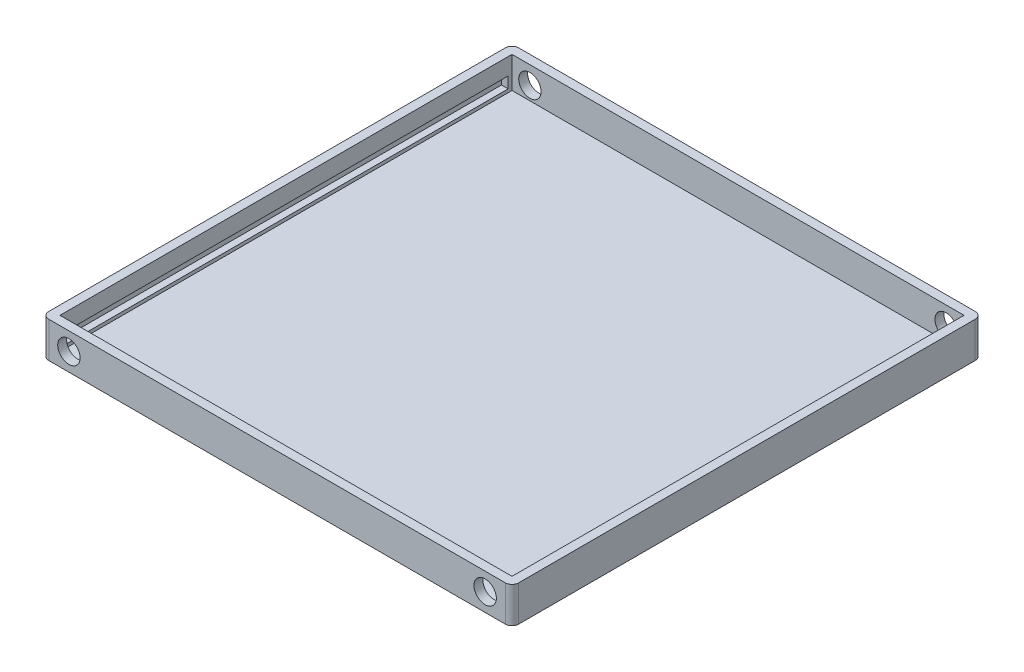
ISO-10303-21;
HEADER;
FILE_DESCRIPTION(('STEP AP214'),'2;1');
FILE_NAME('part.step','',(''),(''),'','','');
FILE_SCHEMA(('AUTOMOTIVE_DESIGN { 1 0 10303 214 1 1 1 1 }'));
ENDSEC;
DATA;
#1=APPLICATION_CONTEXT('core data for automotive mechanical design processes');
#2=APPLICATION_PROTOCOL_DEFINITION('international standard','automotive_design',2000,#1);
#3=PRODUCT_CONTEXT('',#1,'mechanical');
#4=PRODUCT('Part','Part','',(#3));
#5=PRODUCT_RELATED_PRODUCT_CATEGORY('part','',(#4));
#6=PRODUCT_DEFINITION_FORMATION('','',#4);
#7=PRODUCT_DEFINITION_CONTEXT('part definition',#1,'design');
#8=PRODUCT_DEFINITION('design','',#6,#7);
#9=PRODUCT_DEFINITION_SHAPE('','',#8);
#10=(LENGTH_UNIT() NAMED_UNIT(*) SI_UNIT(.MILLI.,.METRE.));
#11=(NAMED_UNIT(*) PLANE_ANGLE_UNIT() SI_UNIT($,.RADIAN.));
#12=(NAMED_UNIT(*) SI_UNIT($,.STERADIAN.) SOLID_ANGLE_UNIT());
#13=UNCERTAINTY_MEASURE_WITH_UNIT(LENGTH_MEASURE(1.E-05),#10,'distance_accuracy_value','');
#14=(GEOMETRIC_REPRESENTATION_CONTEXT(3) GLOBAL_UNCERTAINTY_ASSIGNED_CONTEXT((#13)) GLOBAL_UNIT_ASSIGNED_CONTEXT((#10,
#11,#12)) REPRESENTATION_CONTEXT('',''));
#15=CARTESIAN_POINT('',(0.,0.,0.));
#16=DIRECTION('',(0.,0.,1.));
#17=DIRECTION('',(1.,0.,0.));
#18=AXIS2_PLACEMENT_3D('',#15,#16,#17);
#19=CARTESIAN_POINT('',(50.5,1.,-50.5));
#20=DIRECTION('',(1.,0.,0.));
#21=DIRECTION('',(0.,0.,-1.));
#22=AXIS2_PLACEMENT_3D('',#19,#20,#21);
#23=PLANE('',#22);
#24=DIRECTION('',(0.,0.,-1.));
#25=VECTOR('',#24,1.);
#26=CARTESIAN_POINT('',(50.5,1.74932444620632,-49.6518393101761));
#27=LINE('',#26,#25);
#28=CARTESIAN_POINT('',(50.5,1.74932444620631,50.5));
#29=VERTEX_POINT('',#28);
#30=CARTESIAN_POINT('',(50.5,1.74932444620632,-49.6518393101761));
#31=VERTEX_POINT('',#30);
#32=EDGE_CURVE('E227',#29,#31,#27,.T.);
#33=ORIENTED_EDGE('',*,*,#32,.T.);
#34=DIRECTION('',(0.,1.,0.));
#35=VECTOR('',#34,1.);
#36=CARTESIAN_POINT('',(50.5,4.24932444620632,-49.6518393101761));
#37=LINE('',#36,#35);
#38=CARTESIAN_POINT('',(50.5,4.24932444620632,-49.6518393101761));
#39=VERTEX_POINT('',#38);
#40=EDGE_CURVE('E245',#31,#39,#37,.T.);
#41=ORIENTED_EDGE('',*,*,#40,.T.);
#42=DIRECTION('',(0.,0.,1.));
#43=VECTOR('',#42,1.);
#44=CARTESIAN_POINT('',(50.5,4.24932444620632,-49.6518393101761));
#45=LINE('',#44,#43);
#46=CARTESIAN_POINT('',(50.5,4.24932444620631,50.5));
#47=VERTEX_POINT('',#46);
#48=EDGE_CURVE('E241',#39,#47,#45,.T.);
#49=ORIENTED_EDGE('',*,*,#48,.T.);
#50=DIRECTION('',(0.,1.,0.));
#51=VECTOR('',#50,1.);
#52=CARTESIAN_POINT('',(50.5,1.,50.5));
#53=LINE('',#52,#51);
#54=CARTESIAN_POINT('',(50.5,8.,50.5));
#55=VERTEX_POINT('',#54);
#56=EDGE_CURVE('E349',#47,#55,#53,.T.);
#57=ORIENTED_EDGE('',*,*,#56,.T.);
#58=DIRECTION('',(0.,0.,-1.));
#59=VECTOR('',#58,1.);
#60=CARTESIAN_POINT('',(50.5,8.,-50.5));
#61=LINE('',#60,#59);
#62=CARTESIAN_POINT('',(50.5,8.,-50.5));
#63=VERTEX_POINT('',#62);
#64=EDGE_CURVE('E330',#55,#63,#61,.T.);
#65=ORIENTED_EDGE('',*,*,#64,.T.);
#66=DIRECTION('',(0.,1.,0.));
#67=VECTOR('',#66,1.);
#68=CARTESIAN_POINT('',(50.5,1.,-50.5));
#69=LINE('',#68,#67);
#70=CARTESIAN_POINT('',(50.5,1.,-50.5));
#71=VERTEX_POINT('',#70);
#72=EDGE_CURVE('E341',#71,#63,#69,.T.);
#73=ORIENTED_EDGE('',*,*,#72,.F.);
#74=DIRECTION('',(0.,0.,-1.));
#75=VECTOR('',#74,1.);
#76=CARTESIAN_POINT('',(50.5,1.,-50.5));
#77=LINE('',#76,#75);
#78=CARTESIAN_POINT('',(50.5,1.,50.5));
#79=VERTEX_POINT('',#78);
#80=EDGE_CURVE('E314',#79,#71,#77,.T.);
#81=ORIENTED_EDGE('',*,*,#80,.F.);
#82=EDGE_CURVE('E344',#79,#29,#53,.T.);
#83=ORIENTED_EDGE('',*,*,#82,.T.);
#84=EDGE_LOOP('',(#33,#41,#49,#57,#65,#73,#81,#83));
#85=FACE_BOUND('',#84,.T.);
#86=ADVANCED_FACE('F45',(#85),#23,.F.);
#87=CARTESIAN_POINT('',(-52.5,8.,-52.5));
#88=DIRECTION('',(1.,0.,0.));
#89=DIRECTION('',(0.,0.,-1.));
#90=AXIS2_PLACEMENT_3D('',#87,#88,#89);
#91=PLANE('',#90);
#92=DIRECTION('',(0.,0.,1.));
#93=VECTOR('',#92,1.);
#94=CARTESIAN_POINT('',(-52.5,8.,-52.5));
#95=LINE('',#94,#93);
#96=CARTESIAN_POINT('',(-52.5,8.,-51.));
#97=VERTEX_POINT('',#96);
#98=CARTESIAN_POINT('',(-52.5,8.,51.));
#99=VERTEX_POINT('',#98);
#100=EDGE_CURVE('E355',#97,#99,#95,.T.);
#101=ORIENTED_EDGE('',*,*,#100,.F.);
#102=DIRECTION('',(0.,-1.,0.));
#103=VECTOR('',#102,1.);
#104=CARTESIAN_POINT('',(-52.5,8.,-51.));
#105=LINE('',#104,#103);
#106=CARTESIAN_POINT('',(-52.5,0.,-51.));
#107=VERTEX_POINT('',#106);
#108=EDGE_CURVE('E387',#97,#107,#105,.T.);
#109=ORIENTED_EDGE('',*,*,#108,.T.);
#110=DIRECTION('',(0.,0.,1.));
#111=VECTOR('',#110,1.);
#112=CARTESIAN_POINT('',(-52.5,0.,-52.5));
#113=LINE('',#112,#111);
#114=CARTESIAN_POINT('',(-52.5,0.,51.));
#115=VERTEX_POINT('',#114);
#116=EDGE_CURVE('E340',#107,#115,#113,.T.);
#117=ORIENTED_EDGE('',*,*,#116,.T.);
#118=DIRECTION('',(0.,-1.,0.));
#119=VECTOR('',#118,1.);
#120=CARTESIAN_POINT('',(-52.5,8.,51.));
#121=LINE('',#120,#119);
#122=EDGE_CURVE('E371',#115,#99,#121,.F.);
#123=ORIENTED_EDGE('',*,*,#122,.T.);
#124=EDGE_LOOP('',(#101,#109,#117,#123));
#125=FACE_BOUND('',#124,.T.);
#126=ADVANCED_FACE('F470',(#125),#91,.F.);
#127=CARTESIAN_POINT('',(52.5,8.,52.5));
#128=DIRECTION('',(0.,0.,-1.));
#129=DIRECTION('',(-1.,0.,0.));
#130=AXIS2_PLACEMENT_3D('',#127,#128,#129);
#131=PLANE('',#130);
#132=CARTESIAN_POINT('',(-46.5,4.,52.5));
#133=DIRECTION('',(0.,0.,1.));
#134=DIRECTION('',(1.,0.,0.));
#135=AXIS2_PLACEMENT_3D('',#132,#133,#134);
#136=CIRCLE('',#135,2.5);
#137=CARTESIAN_POINT('',(-44.,4.,52.5));
#138=VERTEX_POINT('',#137);
#139=EDGE_CURVE('E435',#138,#138,#136,.T.);
#140=ORIENTED_EDGE('',*,*,#139,.F.);
#141=EDGE_LOOP('',(#140));
#142=FACE_BOUND('',#141,.T.);
#143=CARTESIAN_POINT('',(46.5,4.,52.5));
#144=DIRECTION('',(0.,0.,1.));
#145=DIRECTION('',(1.,0.,0.));
#146=AXIS2_PLACEMENT_3D('',#143,#144,#145);
#147=CIRCLE('',#146,2.5);
#148=CARTESIAN_POINT('',(49.,4.,52.5));
#149=VERTEX_POINT('',#148);
#150=EDGE_CURVE('E230',#149,#149,#147,.T.);
#151=ORIENTED_EDGE('',*,*,#150,.F.);
#152=EDGE_LOOP('',(#151));
#153=FACE_BOUND('',#152,.T.);
#154=DIRECTION('',(1.,0.,0.));
#155=VECTOR('',#154,1.);
#156=CARTESIAN_POINT('',(52.5,8.,52.5));
#157=LINE('',#156,#155);
#158=CARTESIAN_POINT('',(-51.,8.,52.5));
#159=VERTEX_POINT('',#158);
#160=CARTESIAN_POINT('',(51.,8.,52.5));
#161=VERTEX_POINT('',#160);
#162=EDGE_CURVE('E359',#159,#161,#157,.T.);
#163=ORIENTED_EDGE('',*,*,#162,.F.);
#164=DIRECTION('',(0.,-1.,0.));
#165=VECTOR('',#164,1.);
#166=CARTESIAN_POINT('',(-51.,8.,52.5));
#167=LINE('',#166,#165);
#168=CARTESIAN_POINT('',(-51.,0.,52.5));
#169=VERTEX_POINT('',#168);
#170=EDGE_CURVE('E425',#159,#169,#167,.T.);
#171=ORIENTED_EDGE('',*,*,#170,.T.);
#172=DIRECTION('',(1.,0.,0.));
#173=VECTOR('',#172,1.);
#174=CARTESIAN_POINT('',(52.5,0.,52.5));
#175=LINE('',#174,#173);
#176=CARTESIAN_POINT('',(51.,0.,52.5));
#177=VERTEX_POINT('',#176);
#178=EDGE_CURVE('E375',#169,#177,#175,.T.);
#179=ORIENTED_EDGE('',*,*,#178,.T.);
#180=DIRECTION('',(0.,-1.,0.));
#181=VECTOR('',#180,1.);
#182=CARTESIAN_POINT('',(51.,8.,52.5));
#183=LINE('',#182,#181);
#184=EDGE_CURVE('E422',#177,#161,#183,.F.);
#185=ORIENTED_EDGE('',*,*,#184,.T.);
#186=EDGE_LOOP('',(#163,#171,#179,#185));
#187=FACE_BOUND('',#186,.T.);
#188=ADVANCED_FACE('F466',(#142,#153,#187),#131,.F.);
#189=CARTESIAN_POINT('',(52.5,8.,-52.5));
#190=DIRECTION('',(-1.,0.,0.));
#191=DIRECTION('',(0.,0.,1.));
#192=AXIS2_PLACEMENT_3D('',#189,#190,#191);
#193=PLANE('',#192);
#194=DIRECTION('',(0.,0.,-1.));
#195=VECTOR('',#194,1.);
#196=CARTESIAN_POINT('',(52.5,8.,-52.5));
#197=LINE('',#196,#195);
#198=CARTESIAN_POINT('',(52.5,8.,51.));
#199=VERTEX_POINT('',#198);
#200=CARTESIAN_POINT('',(52.5,8.,-51.));
#201=VERTEX_POINT('',#200);
#202=EDGE_CURVE('E364',#199,#201,#197,.T.);
#203=ORIENTED_EDGE('',*,*,#202,.F.);
#204=DIRECTION('',(0.,-1.,0.));
#205=VECTOR('',#204,1.);
#206=CARTESIAN_POINT('',(52.5,8.,51.));
#207=LINE('',#206,#205);
#208=CARTESIAN_POINT('',(52.5,0.,51.));
#209=VERTEX_POINT('',#208);
#210=EDGE_CURVE('E11',#199,#209,#207,.T.);
#211=ORIENTED_EDGE('',*,*,#210,.T.);
#212=DIRECTION('',(0.,0.,-1.));
#213=VECTOR('',#212,1.);
#214=CARTESIAN_POINT('',(52.5,0.,-52.5));
#215=LINE('',#214,#213);
#216=CARTESIAN_POINT('',(52.5,0.,-51.));
#217=VERTEX_POINT('',#216);
#218=EDGE_CURVE('E379',#209,#217,#215,.T.);
#219=ORIENTED_EDGE('',*,*,#218,.T.);
#220=DIRECTION('',(0.,-1.,0.));
#221=VECTOR('',#220,1.);
#222=CARTESIAN_POINT('',(52.5,8.,-51.));
#223=LINE('',#222,#221);
#224=EDGE_CURVE('E55',#217,#201,#223,.F.);
#225=ORIENTED_EDGE('',*,*,#224,.T.);
#226=EDGE_LOOP('',(#203,#211,#219,#225));
#227=FACE_BOUND('',#226,.T.);
#228=ADVANCED_FACE('F469',(#227),#193,.F.);
#229=CARTESIAN_POINT('',(52.5,8.,-52.5));
#230=DIRECTION('',(0.,0.,1.));
#231=DIRECTION('',(1.,0.,0.));
#232=AXIS2_PLACEMENT_3D('',#229,#230,#231);
#233=PLANE('',#232);
#234=CARTESIAN_POINT('',(-46.5,4.,-52.5));
#235=DIRECTION('',(0.,0.,1.));
#236=DIRECTION('',(1.,0.,0.));
#237=AXIS2_PLACEMENT_3D('',#234,#235,#236);
#238=CIRCLE('',#237,2.5);
#239=CARTESIAN_POINT('',(-44.,4.,-52.5));
#240=VERTEX_POINT('',#239);
#241=EDGE_CURVE('E441',#240,#240,#238,.T.);
#242=ORIENTED_EDGE('',*,*,#241,.T.);
#243=EDGE_LOOP('',(#242));
#244=FACE_BOUND('',#243,.T.);
#245=CARTESIAN_POINT('',(46.5,4.,-52.5));
#246=DIRECTION('',(0.,0.,1.));
#247=DIRECTION('',(1.,0.,0.));
#248=AXIS2_PLACEMENT_3D('',#245,#246,#247);
#249=CIRCLE('',#248,2.5);
#250=CARTESIAN_POINT('',(49.,4.,-52.5));
#251=VERTEX_POINT('',#250);
#252=EDGE_CURVE('E448',#251,#251,#249,.T.);
#253=ORIENTED_EDGE('',*,*,#252,.T.);
#254=EDGE_LOOP('',(#253));
#255=FACE_BOUND('',#254,.T.);
#256=DIRECTION('',(-1.,0.,0.));
#257=VECTOR('',#256,1.);
#258=CARTESIAN_POINT('',(52.5,0.,-52.5));
#259=LINE('',#258,#257);
#260=CARTESIAN_POINT('',(51.,0.,-52.5));
#261=VERTEX_POINT('',#260);
#262=CARTESIAN_POINT('',(-51.,0.,-52.5));
#263=VERTEX_POINT('',#262);
#264=EDGE_CURVE('E360',#261,#263,#259,.T.);
#265=ORIENTED_EDGE('',*,*,#264,.T.);
#266=DIRECTION('',(0.,-1.,0.));
#267=VECTOR('',#266,1.);
#268=CARTESIAN_POINT('',(-51.,8.,-52.5));
#269=LINE('',#268,#267);
#270=CARTESIAN_POINT('',(-51.,8.,-52.5));
#271=VERTEX_POINT('',#270);
#272=EDGE_CURVE('E407',#263,#271,#269,.F.);
#273=ORIENTED_EDGE('',*,*,#272,.T.);
#274=DIRECTION('',(-1.,0.,0.));
#275=VECTOR('',#274,1.);
#276=CARTESIAN_POINT('',(52.5,8.,-52.5));
#277=LINE('',#276,#275);
#278=CARTESIAN_POINT('',(51.,8.,-52.5));
#279=VERTEX_POINT('',#278);
#280=EDGE_CURVE('E367',#279,#271,#277,.T.);
#281=ORIENTED_EDGE('',*,*,#280,.F.);
#282=DIRECTION('',(0.,-1.,0.));
#283=VECTOR('',#282,1.);
#284=CARTESIAN_POINT('',(51.,8.,-52.5));
#285=LINE('',#284,#283);
#286=EDGE_CURVE('E403',#279,#261,#285,.T.);
#287=ORIENTED_EDGE('',*,*,#286,.T.);
#288=EDGE_LOOP('',(#265,#273,#281,#287));
#289=FACE_BOUND('',#288,.T.);
#290=ADVANCED_FACE('F495',(#244,#255,#289),#233,.F.);
#291=CARTESIAN_POINT('',(0.,8.,0.));
#292=DIRECTION('',(0.,-1.,0.));
#293=DIRECTION('',(0.,0.,-1.));
#294=AXIS2_PLACEMENT_3D('',#291,#292,#293);
#295=PLANE('',#294);
#296=DIRECTION('',(1.,0.,0.));
#297=VECTOR('',#296,1.);
#298=CARTESIAN_POINT('',(50.5,8.,50.5));
#299=LINE('',#298,#297);
#300=CARTESIAN_POINT('',(-50.5,8.,50.5));
#301=VERTEX_POINT('',#300);
#302=EDGE_CURVE('E326',#301,#55,#299,.T.);
#303=ORIENTED_EDGE('',*,*,#302,.F.);
#304=DIRECTION('',(0.,0.,1.));
#305=VECTOR('',#304,1.);
#306=CARTESIAN_POINT('',(-50.5,8.,-50.5));
#307=LINE('',#306,#305);
#308=CARTESIAN_POINT('',(-50.5,8.,-50.5));
#309=VERTEX_POINT('',#308);
#310=EDGE_CURVE('E295',#309,#301,#307,.T.);
#311=ORIENTED_EDGE('',*,*,#310,.F.);
#312=DIRECTION('',(-1.,0.,0.));
#313=VECTOR('',#312,1.);
#314=CARTESIAN_POINT('',(50.5,8.,-50.5));
#315=LINE('',#314,#313);
#316=EDGE_CURVE('E310',#63,#309,#315,.T.);
#317=ORIENTED_EDGE('',*,*,#316,.F.);
#318=ORIENTED_EDGE('',*,*,#64,.F.);
#319=EDGE_LOOP('',(#303,#311,#317,#318));
#320=FACE_BOUND('',#319,.T.);
#321=ORIENTED_EDGE('',*,*,#280,.T.);
#322=CARTESIAN_POINT('',(-51.,8.,-51.));
#323=DIRECTION('',(0.,-1.,0.));
#324=DIRECTION('',(0.,0.,-1.));
#325=AXIS2_PLACEMENT_3D('',#322,#323,#324);
#326=CIRCLE('',#325,1.5);
#327=EDGE_CURVE('E419',#271,#97,#326,.F.);
#328=ORIENTED_EDGE('',*,*,#327,.T.);
#329=ORIENTED_EDGE('',*,*,#100,.T.);
#330=CARTESIAN_POINT('',(-51.,8.,51.));
#331=DIRECTION('',(0.,-1.,0.));
#332=DIRECTION('',(0.,0.,-1.));
#333=AXIS2_PLACEMENT_3D('',#330,#331,#332);
#334=CIRCLE('',#333,1.5);
#335=EDGE_CURVE('E416',#99,#159,#334,.F.);
#336=ORIENTED_EDGE('',*,*,#335,.T.);
#337=ORIENTED_EDGE('',*,*,#162,.T.);
#338=CARTESIAN_POINT('',(51.,8.,51.));
#339=DIRECTION('',(0.,-1.,0.));
#340=DIRECTION('',(0.,0.,-1.));
#341=AXIS2_PLACEMENT_3D('',#338,#339,#340);
#342=CIRCLE('',#341,1.5);
#343=EDGE_CURVE('E413',#161,#199,#342,.F.);
#344=ORIENTED_EDGE('',*,*,#343,.T.);
#345=ORIENTED_EDGE('',*,*,#202,.T.);
#346=CARTESIAN_POINT('',(51.,8.,-51.));
#347=DIRECTION('',(0.,-1.,0.));
#348=DIRECTION('',(0.,0.,-1.));
#349=AXIS2_PLACEMENT_3D('',#346,#347,#348);
#350=CIRCLE('',#349,1.5);
#351=EDGE_CURVE('E410',#201,#279,#350,.F.);
#352=ORIENTED_EDGE('',*,*,#351,.T.);
#353=EDGE_LOOP('',(#321,#328,#329,#336,#337,#344,#345,#352));
#354=FACE_BOUND('',#353,.T.);
#355=ADVANCED_FACE('F504',(#320,#354),#295,.F.);
#356=CARTESIAN_POINT('',(0.,0.,0.));
#357=DIRECTION('',(0.,-1.,0.));
#358=DIRECTION('',(0.,0.,-1.));
#359=AXIS2_PLACEMENT_3D('',#356,#357,#358);
#360=PLANE('',#359);
#361=ORIENTED_EDGE('',*,*,#116,.F.);
#362=CARTESIAN_POINT('',(-51.,0.,-51.));
#363=DIRECTION('',(0.,-1.,0.));
#364=DIRECTION('',(0.,0.,-1.));
#365=AXIS2_PLACEMENT_3D('',#362,#363,#364);
#366=CIRCLE('',#365,1.5);
#367=EDGE_CURVE('E400',#107,#263,#366,.T.);
#368=ORIENTED_EDGE('',*,*,#367,.T.);
#369=ORIENTED_EDGE('',*,*,#264,.F.);
#370=CARTESIAN_POINT('',(51.,0.,-51.));
#371=DIRECTION('',(0.,-1.,0.));
#372=DIRECTION('',(0.,0.,-1.));
#373=AXIS2_PLACEMENT_3D('',#370,#371,#372);
#374=CIRCLE('',#373,1.5);
#375=EDGE_CURVE('E391',#261,#217,#374,.T.);
#376=ORIENTED_EDGE('',*,*,#375,.T.);
#377=ORIENTED_EDGE('',*,*,#218,.F.);
#378=CARTESIAN_POINT('',(51.,0.,51.));
#379=DIRECTION('',(0.,-1.,0.));
#380=DIRECTION('',(0.,0.,-1.));
#381=AXIS2_PLACEMENT_3D('',#378,#379,#380);
#382=CIRCLE('',#381,1.5);
#383=EDGE_CURVE('E394',#209,#177,#382,.T.);
#384=ORIENTED_EDGE('',*,*,#383,.T.);
#385=ORIENTED_EDGE('',*,*,#178,.F.);
#386=CARTESIAN_POINT('',(-51.,0.,51.));
#387=DIRECTION('',(0.,-1.,0.));
#388=DIRECTION('',(0.,0.,-1.));
#389=AXIS2_PLACEMENT_3D('',#386,#387,#388);
#390=CIRCLE('',#389,1.5);
#391=EDGE_CURVE('E397',#169,#115,#390,.T.);
#392=ORIENTED_EDGE('',*,*,#391,.T.);
#393=EDGE_LOOP('',(#361,#368,#369,#376,#377,#384,#385,#392));
#394=FACE_BOUND('',#393,.T.);
#395=ADVANCED_FACE('F485',(#394),#360,.T.);
#396=CARTESIAN_POINT('',(-50.5,1.,-50.5));
#397=DIRECTION('',(-1.,0.,0.));
#398=DIRECTION('',(0.,0.,1.));
#399=AXIS2_PLACEMENT_3D('',#396,#397,#398);
#400=PLANE('',#399);
#401=DIRECTION('',(0.,1.,0.));
#402=VECTOR('',#401,1.);
#403=CARTESIAN_POINT('',(-50.5,1.,50.5));
#404=LINE('',#403,#402);
#405=CARTESIAN_POINT('',(-50.5,4.24932444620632,50.5));
#406=VERTEX_POINT('',#405);
#407=EDGE_CURVE('E322',#406,#301,#404,.T.);
#408=ORIENTED_EDGE('',*,*,#407,.F.);
#409=DIRECTION('',(0.,0.,1.));
#410=VECTOR('',#409,1.);
#411=CARTESIAN_POINT('',(-50.5,4.24932444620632,-49.6518393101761));
#412=LINE('',#411,#410);
#413=CARTESIAN_POINT('',(-50.5,4.24932444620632,-49.6518393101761));
#414=VERTEX_POINT('',#413);
#415=EDGE_CURVE('E263',#414,#406,#412,.T.);
#416=ORIENTED_EDGE('',*,*,#415,.F.);
#417=DIRECTION('',(0.,1.,0.));
#418=VECTOR('',#417,1.);
#419=CARTESIAN_POINT('',(-50.5,4.24932444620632,-49.6518393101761));
#420=LINE('',#419,#418);
#421=CARTESIAN_POINT('',(-50.5,1.74932444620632,-49.6518393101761));
#422=VERTEX_POINT('',#421);
#423=EDGE_CURVE('E284',#422,#414,#420,.T.);
#424=ORIENTED_EDGE('',*,*,#423,.F.);
#425=DIRECTION('',(0.,0.,-1.));
#426=VECTOR('',#425,1.);
#427=CARTESIAN_POINT('',(-50.5,1.74932444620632,-49.6518393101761));
#428=LINE('',#427,#426);
#429=CARTESIAN_POINT('',(-50.5,1.74932444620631,50.5));
#430=VERTEX_POINT('',#429);
#431=EDGE_CURVE('E279',#430,#422,#428,.T.);
#432=ORIENTED_EDGE('',*,*,#431,.F.);
#433=CARTESIAN_POINT('',(-50.5,1.,50.5));
#434=VERTEX_POINT('',#433);
#435=EDGE_CURVE('E350',#434,#430,#404,.T.);
#436=ORIENTED_EDGE('',*,*,#435,.F.);
#437=DIRECTION('',(0.,0.,1.));
#438=VECTOR('',#437,1.);
#439=CARTESIAN_POINT('',(-50.5,1.,-50.5));
#440=LINE('',#439,#438);
#441=CARTESIAN_POINT('',(-50.5,1.,-50.5));
#442=VERTEX_POINT('',#441);
#443=EDGE_CURVE('E305',#442,#434,#440,.T.);
#444=ORIENTED_EDGE('',*,*,#443,.F.);
#445=DIRECTION('',(0.,1.,0.));
#446=VECTOR('',#445,1.);
#447=CARTESIAN_POINT('',(-50.5,1.,-50.5));
#448=LINE('',#447,#446);
#449=EDGE_CURVE('E337',#442,#309,#448,.T.);
#450=ORIENTED_EDGE('',*,*,#449,.T.);
#451=ORIENTED_EDGE('',*,*,#310,.T.);
#452=EDGE_LOOP('',(#408,#416,#424,#432,#436,#444,#450,#451));
#453=FACE_BOUND('',#452,.T.);
#454=ADVANCED_FACE('F512',(#453),#400,.F.);
#455=CARTESIAN_POINT('',(50.5,1.,-50.5));
#456=DIRECTION('',(0.,0.,-1.));
#457=DIRECTION('',(-1.,0.,0.));
#458=AXIS2_PLACEMENT_3D('',#455,#456,#457);
#459=PLANE('',#458);
#460=CARTESIAN_POINT('',(-46.5,4.,-50.5));
#461=DIRECTION('',(0.,0.,-1.));
#462=DIRECTION('',(-1.,0.,0.));
#463=AXIS2_PLACEMENT_3D('',#460,#461,#462);
#464=CIRCLE('',#463,2.5);
#465=CARTESIAN_POINT('',(-49.,4.,-50.5));
#466=VERTEX_POINT('',#465);
#467=EDGE_CURVE('E49',#466,#466,#464,.F.);
#468=ORIENTED_EDGE('',*,*,#467,.F.);
#469=EDGE_LOOP('',(#468));
#470=FACE_BOUND('',#469,.T.);
#471=CARTESIAN_POINT('',(46.5,4.,-50.5));
#472=DIRECTION('',(0.,0.,-1.));
#473=DIRECTION('',(-1.,0.,0.));
#474=AXIS2_PLACEMENT_3D('',#471,#472,#473);
#475=CIRCLE('',#474,2.5);
#476=CARTESIAN_POINT('',(44.,4.,-50.5));
#477=VERTEX_POINT('',#476);
#478=EDGE_CURVE('E438',#477,#477,#475,.F.);
#479=ORIENTED_EDGE('',*,*,#478,.F.);
#480=EDGE_LOOP('',(#479));
#481=FACE_BOUND('',#480,.T.);
#482=ORIENTED_EDGE('',*,*,#316,.T.);
#483=ORIENTED_EDGE('',*,*,#449,.F.);
#484=DIRECTION('',(-1.,0.,0.));
#485=VECTOR('',#484,1.);
#486=CARTESIAN_POINT('',(50.5,1.,-50.5));
#487=LINE('',#486,#485);
#488=EDGE_CURVE('E318',#71,#442,#487,.T.);
#489=ORIENTED_EDGE('',*,*,#488,.F.);
#490=ORIENTED_EDGE('',*,*,#72,.T.);
#491=EDGE_LOOP('',(#482,#483,#489,#490));
#492=FACE_BOUND('',#491,.T.);
#493=ADVANCED_FACE('F530',(#470,#481,#492),#459,.F.);
#494=CARTESIAN_POINT('',(50.5,1.,50.5));
#495=DIRECTION('',(0.,0.,1.));
#496=DIRECTION('',(1.,0.,0.));
#497=AXIS2_PLACEMENT_3D('',#494,#495,#496);
#498=PLANE('',#497);
#499=CARTESIAN_POINT('',(-46.5,4.,50.5));
#500=DIRECTION('',(0.,0.,1.));
#501=DIRECTION('',(1.,0.,0.));
#502=AXIS2_PLACEMENT_3D('',#499,#500,#501);
#503=CIRCLE('',#502,2.5);
#504=CARTESIAN_POINT('',(-44.,4.,50.5));
#505=VERTEX_POINT('',#504);
#506=EDGE_CURVE('E240',#505,#505,#503,.T.);
#507=ORIENTED_EDGE('',*,*,#506,.T.);
#508=EDGE_LOOP('',(#507));
#509=FACE_BOUND('',#508,.T.);
#510=CARTESIAN_POINT('',(46.5,4.,50.5));
#511=DIRECTION('',(0.,0.,1.));
#512=DIRECTION('',(1.,0.,0.));
#513=AXIS2_PLACEMENT_3D('',#510,#511,#512);
#514=CIRCLE('',#513,2.5);
#515=CARTESIAN_POINT('',(49.,4.,50.5));
#516=VERTEX_POINT('',#515);
#517=EDGE_CURVE('E431',#516,#516,#514,.T.);
#518=ORIENTED_EDGE('',*,*,#517,.T.);
#519=EDGE_LOOP('',(#518));
#520=FACE_BOUND('',#519,.T.);
#521=ORIENTED_EDGE('',*,*,#302,.T.);
#522=ORIENTED_EDGE('',*,*,#56,.F.);
#523=EDGE_CURVE('E348',#29,#47,#53,.T.);
#524=ORIENTED_EDGE('',*,*,#523,.F.);
#525=ORIENTED_EDGE('',*,*,#82,.F.);
#526=DIRECTION('',(1.,0.,0.));
#527=VECTOR('',#526,1.);
#528=CARTESIAN_POINT('',(50.5,1.,50.5));
#529=LINE('',#528,#527);
#530=EDGE_CURVE('E309',#434,#79,#529,.T.);
#531=ORIENTED_EDGE('',*,*,#530,.F.);
#532=ORIENTED_EDGE('',*,*,#435,.T.);
#533=EDGE_CURVE('E354',#430,#406,#404,.T.);
#534=ORIENTED_EDGE('',*,*,#533,.T.);
#535=ORIENTED_EDGE('',*,*,#407,.T.);
#536=EDGE_LOOP('',(#521,#522,#524,#525,#531,#532,#534,#535));
#537=FACE_BOUND('',#536,.T.);
#538=ADVANCED_FACE('F532',(#509,#520,#537),#498,.F.);
#539=CARTESIAN_POINT('',(0.,1.,0.));
#540=DIRECTION('',(0.,-1.,0.));
#541=DIRECTION('',(0.,0.,-1.));
#542=AXIS2_PLACEMENT_3D('',#539,#540,#541);
#543=PLANE('',#542);
#544=ORIENTED_EDGE('',*,*,#443,.T.);
#545=ORIENTED_EDGE('',*,*,#530,.T.);
#546=ORIENTED_EDGE('',*,*,#80,.T.);
#547=ORIENTED_EDGE('',*,*,#488,.T.);
#548=EDGE_LOOP('',(#544,#545,#546,#547));
#549=FACE_BOUND('',#548,.T.);
#550=ADVANCED_FACE('F534',(#549),#543,.F.);
#551=CARTESIAN_POINT('',(-50.5,0.,0.));
#552=DIRECTION('',(-1.,0.,0.));
#553=DIRECTION('',(0.,0.,1.));
#554=AXIS2_PLACEMENT_3D('',#551,#552,#553);
#555=PLANE('',#554);
#556=ORIENTED_EDGE('',*,*,#533,.F.);
#557=CARTESIAN_POINT('',(-50.5,1.74932444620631,51.3481606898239));
#558=VERTEX_POINT('',#557);
#559=EDGE_CURVE('E280',#558,#430,#428,.T.);
#560=ORIENTED_EDGE('',*,*,#559,.F.);
#561=DIRECTION('',(0.,-1.,0.));
#562=VECTOR('',#561,1.);
#563=CARTESIAN_POINT('',(-50.5,4.24932444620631,51.3481606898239));
#564=LINE('',#563,#562);
#565=CARTESIAN_POINT('',(-50.5,4.24932444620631,51.3481606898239));
#566=VERTEX_POINT('',#565);
#567=EDGE_CURVE('E252',#566,#558,#564,.T.);
#568=ORIENTED_EDGE('',*,*,#567,.F.);
#569=EDGE_CURVE('E288',#406,#566,#412,.T.);
#570=ORIENTED_EDGE('',*,*,#569,.F.);
#571=EDGE_LOOP('',(#556,#560,#568,#570));
#572=FACE_BOUND('',#571,.T.);
#573=ADVANCED_FACE('F572',(#572),#555,.T.);
#574=CARTESIAN_POINT('',(-52.,4.24932444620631,51.3481606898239));
#575=DIRECTION('',(0.,0.,1.));
#576=DIRECTION('',(1.,0.,0.));
#577=AXIS2_PLACEMENT_3D('',#574,#575,#576);
#578=PLANE('',#577);
#579=ORIENTED_EDGE('',*,*,#567,.T.);
#580=DIRECTION('',(1.,0.,0.));
#581=VECTOR('',#580,1.);
#582=CARTESIAN_POINT('',(-52.,1.74932444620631,51.3481606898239));
#583=LINE('',#582,#581);
#584=CARTESIAN_POINT('',(-52.,1.74932444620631,51.3481606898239));
#585=VERTEX_POINT('',#584);
#586=EDGE_CURVE('E275',#585,#558,#583,.T.);
#587=ORIENTED_EDGE('',*,*,#586,.F.);
#588=DIRECTION('',(0.,-1.,0.));
#589=VECTOR('',#588,1.);
#590=CARTESIAN_POINT('',(-52.,4.24932444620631,51.3481606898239));
#591=LINE('',#590,#589);
#592=CARTESIAN_POINT('',(-52.,4.24932444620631,51.3481606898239));
#593=VERTEX_POINT('',#592);
#594=EDGE_CURVE('E258',#593,#585,#591,.T.);
#595=ORIENTED_EDGE('',*,*,#594,.F.);
#596=DIRECTION('',(1.,0.,0.));
#597=VECTOR('',#596,1.);
#598=CARTESIAN_POINT('',(-52.,4.24932444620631,51.3481606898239));
#599=LINE('',#598,#597);
#600=EDGE_CURVE('E291',#593,#566,#599,.T.);
#601=ORIENTED_EDGE('',*,*,#600,.T.);
#602=EDGE_LOOP('',(#579,#587,#595,#601));
#603=FACE_BOUND('',#602,.T.);
#604=ADVANCED_FACE('F573',(#603),#578,.F.);
#605=CARTESIAN_POINT('',(-52.,4.24932444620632,-49.6518393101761));
#606=DIRECTION('',(0.,1.,0.));
#607=DIRECTION('',(0.,0.,1.));
#608=AXIS2_PLACEMENT_3D('',#605,#606,#607);
#609=PLANE('',#608);
#610=ORIENTED_EDGE('',*,*,#415,.T.);
#611=ORIENTED_EDGE('',*,*,#569,.T.);
#612=ORIENTED_EDGE('',*,*,#600,.F.);
#613=DIRECTION('',(0.,0.,1.));
#614=VECTOR('',#613,1.);
#615=CARTESIAN_POINT('',(-52.,4.24932444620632,-49.6518393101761));
#616=LINE('',#615,#614);
#617=CARTESIAN_POINT('',(-52.,4.24932444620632,-49.6518393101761));
#618=VERTEX_POINT('',#617);
#619=EDGE_CURVE('E271',#618,#593,#616,.T.);
#620=ORIENTED_EDGE('',*,*,#619,.F.);
#621=DIRECTION('',(1.,0.,0.));
#622=VECTOR('',#621,1.);
#623=CARTESIAN_POINT('',(-52.,4.24932444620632,-49.6518393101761));
#624=LINE('',#623,#622);
#625=EDGE_CURVE('E296',#618,#414,#624,.T.);
#626=ORIENTED_EDGE('',*,*,#625,.T.);
#627=EDGE_LOOP('',(#610,#611,#612,#620,#626));
#628=FACE_BOUND('',#627,.T.);
#629=ADVANCED_FACE('F575',(#628),#609,.F.);
#630=CARTESIAN_POINT('',(-52.,4.24932444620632,-49.6518393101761));
#631=DIRECTION('',(0.,0.,-1.));
#632=DIRECTION('',(-1.,0.,0.));
#633=AXIS2_PLACEMENT_3D('',#630,#631,#632);
#634=PLANE('',#633);
#635=ORIENTED_EDGE('',*,*,#423,.T.);
#636=ORIENTED_EDGE('',*,*,#625,.F.);
#637=DIRECTION('',(0.,1.,0.));
#638=VECTOR('',#637,1.);
#639=CARTESIAN_POINT('',(-52.,4.24932444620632,-49.6518393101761));
#640=LINE('',#639,#638);
#641=CARTESIAN_POINT('',(-52.,1.74932444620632,-49.6518393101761));
#642=VERTEX_POINT('',#641);
#643=EDGE_CURVE('E267',#642,#618,#640,.T.);
#644=ORIENTED_EDGE('',*,*,#643,.F.);
#645=DIRECTION('',(1.,0.,0.));
#646=VECTOR('',#645,1.);
#647=CARTESIAN_POINT('',(-52.,1.74932444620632,-49.6518393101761));
#648=LINE('',#647,#646);
#649=EDGE_CURVE('E299',#642,#422,#648,.T.);
#650=ORIENTED_EDGE('',*,*,#649,.T.);
#651=EDGE_LOOP('',(#635,#636,#644,#650));
#652=FACE_BOUND('',#651,.T.);
#653=ADVANCED_FACE('F565',(#652),#634,.F.);
#654=CARTESIAN_POINT('',(-52.,1.74932444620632,-49.6518393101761));
#655=DIRECTION('',(0.,-1.,0.));
#656=DIRECTION('',(0.,0.,-1.));
#657=AXIS2_PLACEMENT_3D('',#654,#655,#656);
#658=PLANE('',#657);
#659=ORIENTED_EDGE('',*,*,#559,.T.);
#660=ORIENTED_EDGE('',*,*,#431,.T.);
#661=ORIENTED_EDGE('',*,*,#649,.F.);
#662=DIRECTION('',(0.,0.,-1.));
#663=VECTOR('',#662,1.);
#664=CARTESIAN_POINT('',(-52.,1.74932444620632,-49.6518393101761));
#665=LINE('',#664,#663);
#666=EDGE_CURVE('E262',#585,#642,#665,.T.);
#667=ORIENTED_EDGE('',*,*,#666,.F.);
#668=ORIENTED_EDGE('',*,*,#586,.T.);
#669=EDGE_LOOP('',(#659,#660,#661,#667,#668));
#670=FACE_BOUND('',#669,.T.);
#671=ADVANCED_FACE('F561',(#670),#658,.F.);
#672=CARTESIAN_POINT('',(-52.,0.,0.));
#673=DIRECTION('',(-1.,0.,0.));
#674=DIRECTION('',(0.,0.,1.));
#675=AXIS2_PLACEMENT_3D('',#672,#673,#674);
#676=PLANE('',#675);
#677=ORIENTED_EDGE('',*,*,#594,.T.);
#678=ORIENTED_EDGE('',*,*,#666,.T.);
#679=ORIENTED_EDGE('',*,*,#643,.T.);
#680=ORIENTED_EDGE('',*,*,#619,.T.);
#681=EDGE_LOOP('',(#677,#678,#679,#680));
#682=FACE_BOUND('',#681,.T.);
#683=ADVANCED_FACE('F568',(#682),#676,.F.);
#684=CARTESIAN_POINT('',(-51.,8.,-51.));
#685=DIRECTION('',(0.,-1.,0.));
#686=DIRECTION('',(0.,0.,-1.));
#687=AXIS2_PLACEMENT_3D('',#684,#685,#686);
#688=CYLINDRICAL_SURFACE('',#687,1.5);
#689=ORIENTED_EDGE('',*,*,#327,.F.);
#690=ORIENTED_EDGE('',*,*,#272,.F.);
#691=ORIENTED_EDGE('',*,*,#367,.F.);
#692=ORIENTED_EDGE('',*,*,#108,.F.);
#693=EDGE_LOOP('',(#689,#690,#691,#692));
#694=FACE_BOUND('',#693,.T.);
#695=ADVANCED_FACE('F491',(#694),#688,.T.);
#696=CARTESIAN_POINT('',(-51.,8.,51.));
#697=DIRECTION('',(0.,-1.,0.));
#698=DIRECTION('',(0.,0.,-1.));
#699=AXIS2_PLACEMENT_3D('',#696,#697,#698);
#700=CYLINDRICAL_SURFACE('',#699,1.5);
#701=ORIENTED_EDGE('',*,*,#335,.F.);
#702=ORIENTED_EDGE('',*,*,#122,.F.);
#703=ORIENTED_EDGE('',*,*,#391,.F.);
#704=ORIENTED_EDGE('',*,*,#170,.F.);
#705=EDGE_LOOP('',(#701,#702,#703,#704));
#706=FACE_BOUND('',#705,.T.);
#707=ADVANCED_FACE('F481',(#706),#700,.T.);
#708=CARTESIAN_POINT('',(51.,8.,51.));
#709=DIRECTION('',(0.,-1.,0.));
#710=DIRECTION('',(0.,0.,-1.));
#711=AXIS2_PLACEMENT_3D('',#708,#709,#710);
#712=CYLINDRICAL_SURFACE('',#711,1.5);
#713=ORIENTED_EDGE('',*,*,#343,.F.);
#714=ORIENTED_EDGE('',*,*,#184,.F.);
#715=ORIENTED_EDGE('',*,*,#383,.F.);
#716=ORIENTED_EDGE('',*,*,#210,.F.);
#717=EDGE_LOOP('',(#713,#714,#715,#716));
#718=FACE_BOUND('',#717,.T.);
#719=ADVANCED_FACE('F503',(#718),#712,.T.);
#720=CARTESIAN_POINT('',(51.,8.,-51.));
#721=DIRECTION('',(0.,-1.,0.));
#722=DIRECTION('',(0.,0.,-1.));
#723=AXIS2_PLACEMENT_3D('',#720,#721,#722);
#724=CYLINDRICAL_SURFACE('',#723,1.5);
#725=ORIENTED_EDGE('',*,*,#351,.F.);
#726=ORIENTED_EDGE('',*,*,#224,.F.);
#727=ORIENTED_EDGE('',*,*,#375,.F.);
#728=ORIENTED_EDGE('',*,*,#286,.F.);
#729=EDGE_LOOP('',(#725,#726,#727,#728));
#730=FACE_BOUND('',#729,.T.);
#731=ADVANCED_FACE('F47',(#730),#724,.T.);
#732=CARTESIAN_POINT('',(50.5,0.,0.));
#733=DIRECTION('',(1.,0.,0.));
#734=DIRECTION('',(0.,0.,1.));
#735=AXIS2_PLACEMENT_3D('',#732,#733,#734);
#736=PLANE('',#735);
#737=ORIENTED_EDGE('',*,*,#523,.T.);
#738=CARTESIAN_POINT('',(50.5,4.24932444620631,51.3481606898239));
#739=VERTEX_POINT('',#738);
#740=EDGE_CURVE('E239',#47,#739,#45,.T.);
#741=ORIENTED_EDGE('',*,*,#740,.T.);
#742=DIRECTION('',(0.,-1.,0.));
#743=VECTOR('',#742,1.);
#744=CARTESIAN_POINT('',(50.5,4.24932444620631,51.3481606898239));
#745=LINE('',#744,#743);
#746=CARTESIAN_POINT('',(50.5,1.74932444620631,51.3481606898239));
#747=VERTEX_POINT('',#746);
#748=EDGE_CURVE('E219',#739,#747,#745,.T.);
#749=ORIENTED_EDGE('',*,*,#748,.T.);
#750=EDGE_CURVE('E63',#747,#29,#27,.T.);
#751=ORIENTED_EDGE('',*,*,#750,.T.);
#752=EDGE_LOOP('',(#737,#741,#749,#751));
#753=FACE_BOUND('',#752,.T.);
#754=ADVANCED_FACE('F600',(#753),#736,.T.);
#755=CARTESIAN_POINT('',(52.,4.24932444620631,51.3481606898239));
#756=DIRECTION('',(0.,0.,-1.));
#757=DIRECTION('',(-1.,0.,0.));
#758=AXIS2_PLACEMENT_3D('',#755,#756,#757);
#759=PLANE('',#758);
#760=ORIENTED_EDGE('',*,*,#748,.F.);
#761=DIRECTION('',(-1.,0.,0.));
#762=VECTOR('',#761,1.);
#763=CARTESIAN_POINT('',(52.,4.24932444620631,51.3481606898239));
#764=LINE('',#763,#762);
#765=CARTESIAN_POINT('',(52.,4.24932444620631,51.3481606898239));
#766=VERTEX_POINT('',#765);
#767=EDGE_CURVE('E204',#766,#739,#764,.T.);
#768=ORIENTED_EDGE('',*,*,#767,.F.);
#769=DIRECTION('',(0.,-1.,0.));
#770=VECTOR('',#769,1.);
#771=CARTESIAN_POINT('',(52.,4.24932444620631,51.3481606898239));
#772=LINE('',#771,#770);
#773=CARTESIAN_POINT('',(52.,1.74932444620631,51.3481606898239));
#774=VERTEX_POINT('',#773);
#775=EDGE_CURVE('E212',#766,#774,#772,.T.);
#776=ORIENTED_EDGE('',*,*,#775,.T.);
#777=DIRECTION('',(-1.,0.,0.));
#778=VECTOR('',#777,1.);
#779=CARTESIAN_POINT('',(52.,1.74932444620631,51.3481606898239));
#780=LINE('',#779,#778);
#781=EDGE_CURVE('E249',#774,#747,#780,.T.);
#782=ORIENTED_EDGE('',*,*,#781,.T.);
#783=EDGE_LOOP('',(#760,#768,#776,#782));
#784=FACE_BOUND('',#783,.T.);
#785=ADVANCED_FACE('F216',(#784),#759,.T.);
#786=CARTESIAN_POINT('',(52.,1.74932444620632,-49.6518393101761));
#787=DIRECTION('',(0.,1.,0.));
#788=DIRECTION('',(0.,0.,1.));
#789=AXIS2_PLACEMENT_3D('',#786,#787,#788);
#790=PLANE('',#789);
#791=ORIENTED_EDGE('',*,*,#750,.F.);
#792=ORIENTED_EDGE('',*,*,#781,.F.);
#793=DIRECTION('',(0.,0.,-1.));
#794=VECTOR('',#793,1.);
#795=CARTESIAN_POINT('',(52.,1.74932444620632,-49.6518393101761));
#796=LINE('',#795,#794);
#797=CARTESIAN_POINT('',(52.,1.74932444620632,-49.6518393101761));
#798=VERTEX_POINT('',#797);
#799=EDGE_CURVE('E221',#774,#798,#796,.T.);
#800=ORIENTED_EDGE('',*,*,#799,.T.);
#801=DIRECTION('',(-1.,0.,0.));
#802=VECTOR('',#801,1.);
#803=CARTESIAN_POINT('',(52.,1.74932444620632,-49.6518393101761));
#804=LINE('',#803,#802);
#805=EDGE_CURVE('E253',#798,#31,#804,.T.);
#806=ORIENTED_EDGE('',*,*,#805,.T.);
#807=ORIENTED_EDGE('',*,*,#32,.F.);
#808=EDGE_LOOP('',(#791,#792,#800,#806,#807));
#809=FACE_BOUND('',#808,.T.);
#810=ADVANCED_FACE('F607',(#809),#790,.T.);
#811=CARTESIAN_POINT('',(52.,4.24932444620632,-49.6518393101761));
#812=DIRECTION('',(0.,0.,1.));
#813=DIRECTION('',(1.,0.,0.));
#814=AXIS2_PLACEMENT_3D('',#811,#812,#813);
#815=PLANE('',#814);
#816=ORIENTED_EDGE('',*,*,#40,.F.);
#817=ORIENTED_EDGE('',*,*,#805,.F.);
#818=DIRECTION('',(0.,1.,0.));
#819=VECTOR('',#818,1.);
#820=CARTESIAN_POINT('',(52.,4.24932444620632,-49.6518393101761));
#821=LINE('',#820,#819);
#822=CARTESIAN_POINT('',(52.,4.24932444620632,-49.6518393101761));
#823=VERTEX_POINT('',#822);
#824=EDGE_CURVE('E211',#798,#823,#821,.T.);
#825=ORIENTED_EDGE('',*,*,#824,.T.);
#826=DIRECTION('',(-1.,0.,0.));
#827=VECTOR('',#826,1.);
#828=CARTESIAN_POINT('',(52.,4.24932444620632,-49.6518393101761));
#829=LINE('',#828,#827);
#830=EDGE_CURVE('E206',#823,#39,#829,.T.);
#831=ORIENTED_EDGE('',*,*,#830,.T.);
#832=EDGE_LOOP('',(#816,#817,#825,#831));
#833=FACE_BOUND('',#832,.T.);
#834=ADVANCED_FACE('F605',(#833),#815,.T.);
#835=CARTESIAN_POINT('',(52.,4.24932444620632,-49.6518393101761));
#836=DIRECTION('',(0.,-1.,0.));
#837=DIRECTION('',(0.,0.,-1.));
#838=AXIS2_PLACEMENT_3D('',#835,#836,#837);
#839=PLANE('',#838);
#840=ORIENTED_EDGE('',*,*,#48,.F.);
#841=ORIENTED_EDGE('',*,*,#830,.F.);
#842=DIRECTION('',(0.,0.,1.));
#843=VECTOR('',#842,1.);
#844=CARTESIAN_POINT('',(52.,4.24932444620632,-49.6518393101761));
#845=LINE('',#844,#843);
#846=EDGE_CURVE('E199',#823,#766,#845,.T.);
#847=ORIENTED_EDGE('',*,*,#846,.T.);
#848=ORIENTED_EDGE('',*,*,#767,.T.);
#849=ORIENTED_EDGE('',*,*,#740,.F.);
#850=EDGE_LOOP('',(#840,#841,#847,#848,#849));
#851=FACE_BOUND('',#850,.T.);
#852=ADVANCED_FACE('F202',(#851),#839,.T.);
#853=CARTESIAN_POINT('',(52.,0.,0.));
#854=DIRECTION('',(1.,0.,0.));
#855=DIRECTION('',(0.,0.,1.));
#856=AXIS2_PLACEMENT_3D('',#853,#854,#855);
#857=PLANE('',#856);
#858=ORIENTED_EDGE('',*,*,#775,.F.);
#859=ORIENTED_EDGE('',*,*,#846,.F.);
#860=ORIENTED_EDGE('',*,*,#824,.F.);
#861=ORIENTED_EDGE('',*,*,#799,.F.);
#862=EDGE_LOOP('',(#858,#859,#860,#861));
#863=FACE_BOUND('',#862,.T.);
#864=ADVANCED_FACE('F223',(#863),#857,.F.);
#865=CARTESIAN_POINT('',(46.5,4.,42.5));
#866=DIRECTION('',(0.,0.,1.));
#867=DIRECTION('',(1.,0.,0.));
#868=AXIS2_PLACEMENT_3D('',#865,#866,#867);
#869=CYLINDRICAL_SURFACE('',#868,2.5);
#870=ORIENTED_EDGE('',*,*,#150,.T.);
#871=EDGE_LOOP('',(#870));
#872=FACE_BOUND('',#871,.T.);
#873=ORIENTED_EDGE('',*,*,#517,.F.);
#874=EDGE_LOOP('',(#873));
#875=FACE_BOUND('',#874,.T.);
#876=ADVANCED_FACE('F463',(#872,#875),#869,.F.);
#877=CARTESIAN_POINT('',(-46.5,4.,42.5));
#878=DIRECTION('',(0.,0.,1.));
#879=DIRECTION('',(1.,0.,0.));
#880=AXIS2_PLACEMENT_3D('',#877,#878,#879);
#881=CYLINDRICAL_SURFACE('',#880,2.5);
#882=ORIENTED_EDGE('',*,*,#139,.T.);
#883=EDGE_LOOP('',(#882));
#884=FACE_BOUND('',#883,.T.);
#885=ORIENTED_EDGE('',*,*,#506,.F.);
#886=EDGE_LOOP('',(#885));
#887=FACE_BOUND('',#886,.T.);
#888=ADVANCED_FACE('F676',(#884,#887),#881,.F.);
#889=CARTESIAN_POINT('',(46.5,4.,-42.5));
#890=DIRECTION('',(0.,0.,-1.));
#891=DIRECTION('',(-1.,0.,0.));
#892=AXIS2_PLACEMENT_3D('',#889,#890,#891);
#893=CYLINDRICAL_SURFACE('',#892,2.5);
#894=ORIENTED_EDGE('',*,*,#252,.F.);
#895=EDGE_LOOP('',(#894));
#896=FACE_BOUND('',#895,.T.);
#897=ORIENTED_EDGE('',*,*,#478,.T.);
#898=EDGE_LOOP('',(#897));
#899=FACE_BOUND('',#898,.T.);
#900=ADVANCED_FACE('F685',(#896,#899),#893,.F.);
#901=CARTESIAN_POINT('',(-46.5,4.,-42.5));
#902=DIRECTION('',(0.,0.,-1.));
#903=DIRECTION('',(-1.,0.,0.));
#904=AXIS2_PLACEMENT_3D('',#901,#902,#903);
#905=CYLINDRICAL_SURFACE('',#904,2.5);
#906=ORIENTED_EDGE('',*,*,#241,.F.);
#907=EDGE_LOOP('',(#906));
#908=FACE_BOUND('',#907,.T.);
#909=ORIENTED_EDGE('',*,*,#467,.T.);
#910=EDGE_LOOP('',(#909));
#911=FACE_BOUND('',#910,.T.);
#912=ADVANCED_FACE('F694',(#908,#911),#905,.F.);
#913=CLOSED_SHELL('',(#86,#126,#188,#228,#290,#355,#395,#454,#493,#538,#550,#573,#604,#629,#653,
#671,#683,#695,#707,#719,#731,#754,#785,#810,#834,#852,#864,#876,#888,#900,#912));
#914=MANIFOLD_SOLID_BREP('B2',#913);
#915=ADVANCED_BREP_SHAPE_REPRESENTATION('',(#18,#914),#14);
#916=SHAPE_DEFINITION_REPRESENTATION(#9,#915);
ENDSEC;
END-ISO-10303-21;
